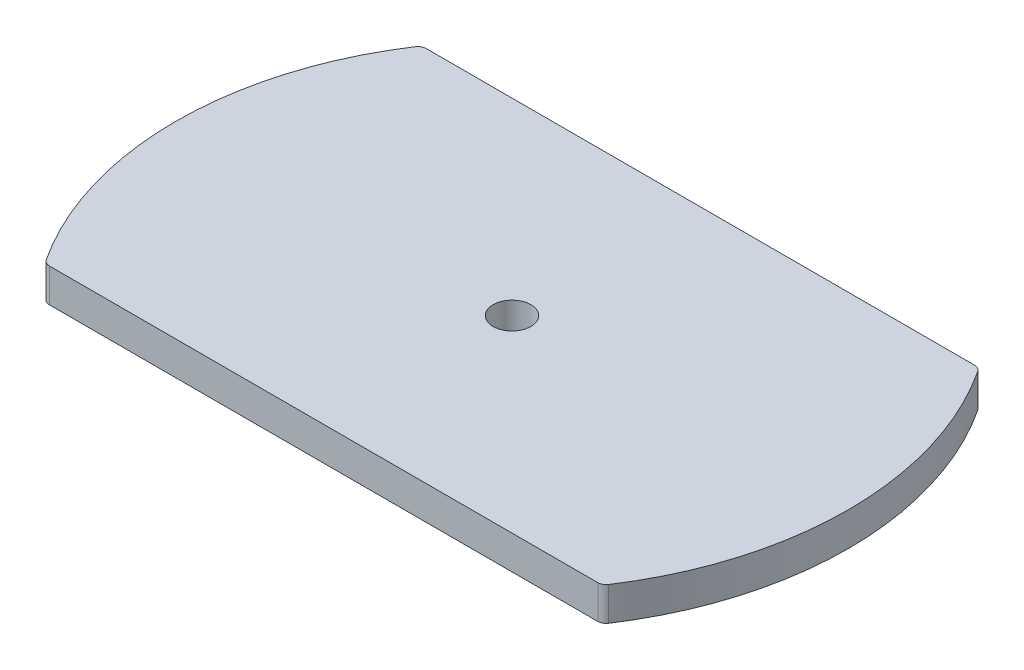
ISO-10303-21;
HEADER;
FILE_DESCRIPTION(('STEP AP214'),'2;1');
FILE_NAME('part.step','',(''),(''),'','','');
FILE_SCHEMA(('AUTOMOTIVE_DESIGN { 1 0 10303 214 1 1 1 1 }'));
ENDSEC;
DATA;
#1=APPLICATION_CONTEXT('core data for automotive mechanical design processes');
#2=APPLICATION_PROTOCOL_DEFINITION('international standard','automotive_design',2000,#1);
#3=PRODUCT_CONTEXT('',#1,'mechanical');
#4=PRODUCT('Part','Part','',(#3));
#5=PRODUCT_RELATED_PRODUCT_CATEGORY('part','',(#4));
#6=PRODUCT_DEFINITION_FORMATION('','',#4);
#7=PRODUCT_DEFINITION_CONTEXT('part definition',#1,'design');
#8=PRODUCT_DEFINITION('design','',#6,#7);
#9=PRODUCT_DEFINITION_SHAPE('','',#8);
#10=(LENGTH_UNIT() NAMED_UNIT(*) SI_UNIT(.MILLI.,.METRE.));
#11=(NAMED_UNIT(*) PLANE_ANGLE_UNIT() SI_UNIT($,.RADIAN.));
#12=(NAMED_UNIT(*) SI_UNIT($,.STERADIAN.) SOLID_ANGLE_UNIT());
#13=UNCERTAINTY_MEASURE_WITH_UNIT(LENGTH_MEASURE(1.E-05),#10,'distance_accuracy_value','');
#14=(GEOMETRIC_REPRESENTATION_CONTEXT(3) GLOBAL_UNCERTAINTY_ASSIGNED_CONTEXT((#13)) GLOBAL_UNIT_ASSIGNED_CONTEXT((#10,
#11,#12)) REPRESENTATION_CONTEXT('',''));
#15=CARTESIAN_POINT('',(0.,0.,0.));
#16=DIRECTION('',(0.,0.,1.));
#17=DIRECTION('',(1.,0.,0.));
#18=AXIS2_PLACEMENT_3D('',#15,#16,#17);
#19=CARTESIAN_POINT('',(-70.485,6.35,32.385));
#20=DIRECTION('',(0.,-1.,0.));
#21=DIRECTION('',(0.,0.,-1.));
#22=AXIS2_PLACEMENT_3D('',#19,#20,#21);
#23=PLANE('',#22);
#24=CARTESIAN_POINT('',(0.,6.35,0.));
#25=DIRECTION('',(0.,1.,0.));
#26=DIRECTION('',(0.,0.,1.));
#27=AXIS2_PLACEMENT_3D('',#24,#25,#26);
#28=CIRCLE('',#27,3.571875);
#29=CARTESIAN_POINT('',(0.,6.35,3.57187499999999));
#30=VERTEX_POINT('',#29);
#31=EDGE_CURVE('E124',#30,#30,#28,.T.);
#32=ORIENTED_EDGE('',*,*,#31,.F.);
#33=EDGE_LOOP('',(#32));
#34=FACE_BOUND('',#33,.T.);
#35=DIRECTION('',(1.,0.,0.));
#36=VECTOR('',#35,1.);
#37=CARTESIAN_POINT('',(-70.485,6.35,35.56));
#38=LINE('',#37,#36);
#39=CARTESIAN_POINT('',(-51.7593170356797,6.35,35.56));
#40=VERTEX_POINT('',#39);
#41=CARTESIAN_POINT('',(51.7593170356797,6.35,35.56));
#42=VERTEX_POINT('',#41);
#43=EDGE_CURVE('E115',#40,#42,#38,.T.);
#44=ORIENTED_EDGE('',*,*,#43,.T.);
#45=CARTESIAN_POINT('',(51.7593170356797,6.35,33.9725));
#46=DIRECTION('',(0.,-1.,0.));
#47=DIRECTION('',(0.,0.,-1.));
#48=AXIS2_PLACEMENT_3D('',#45,#46,#47);
#49=CIRCLE('',#48,1.5875);
#50=CARTESIAN_POINT('',(53.0864790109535,6.35,34.8435897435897));
#51=VERTEX_POINT('',#50);
#52=EDGE_CURVE('E140',#42,#51,#49,.F.);
#53=ORIENTED_EDGE('',*,*,#52,.T.);
#54=CARTESIAN_POINT('',(0.,6.35,0.));
#55=DIRECTION('',(0.,1.,0.));
#56=DIRECTION('',(0.,0.,1.));
#57=AXIS2_PLACEMENT_3D('',#54,#55,#56);
#58=CIRCLE('',#57,63.5);
#59=CARTESIAN_POINT('',(53.0864790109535,6.35,-34.8435897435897));
#60=VERTEX_POINT('',#59);
#61=EDGE_CURVE('E161',#51,#60,#58,.T.);
#62=ORIENTED_EDGE('',*,*,#61,.T.);
#63=CARTESIAN_POINT('',(51.7593170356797,6.35,-33.9725));
#64=DIRECTION('',(0.,-1.,0.));
#65=DIRECTION('',(0.,0.,-1.));
#66=AXIS2_PLACEMENT_3D('',#63,#64,#65);
#67=CIRCLE('',#66,1.5875);
#68=CARTESIAN_POINT('',(51.7593170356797,6.35,-35.56));
#69=VERTEX_POINT('',#68);
#70=EDGE_CURVE('E138',#60,#69,#67,.F.);
#71=ORIENTED_EDGE('',*,*,#70,.T.);
#72=DIRECTION('',(-1.,0.,0.));
#73=VECTOR('',#72,1.);
#74=CARTESIAN_POINT('',(-70.485,6.35,-35.56));
#75=LINE('',#74,#73);
#76=CARTESIAN_POINT('',(-51.7593170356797,6.35,-35.56));
#77=VERTEX_POINT('',#76);
#78=EDGE_CURVE('E117',#69,#77,#75,.T.);
#79=ORIENTED_EDGE('',*,*,#78,.T.);
#80=CARTESIAN_POINT('',(-51.7593170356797,6.35,-33.9725));
#81=DIRECTION('',(0.,-1.,0.));
#82=DIRECTION('',(0.,0.,-1.));
#83=AXIS2_PLACEMENT_3D('',#80,#81,#82);
#84=CIRCLE('',#83,1.5875);
#85=CARTESIAN_POINT('',(-53.0864790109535,6.35,-34.8435897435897));
#86=VERTEX_POINT('',#85);
#87=EDGE_CURVE('E136',#77,#86,#84,.F.);
#88=ORIENTED_EDGE('',*,*,#87,.T.);
#89=CARTESIAN_POINT('',(-53.0864790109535,6.35,34.8435897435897));
#90=VERTEX_POINT('',#89);
#91=EDGE_CURVE('E156',#86,#90,#58,.T.);
#92=ORIENTED_EDGE('',*,*,#91,.T.);
#93=CARTESIAN_POINT('',(-51.7593170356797,6.35,33.9725));
#94=DIRECTION('',(0.,-1.,0.));
#95=DIRECTION('',(0.,0.,-1.));
#96=AXIS2_PLACEMENT_3D('',#93,#94,#95);
#97=CIRCLE('',#96,1.5875);
#98=EDGE_CURVE('E134',#90,#40,#97,.F.);
#99=ORIENTED_EDGE('',*,*,#98,.T.);
#100=EDGE_LOOP('',(#44,#53,#62,#71,#79,#88,#92,#99));
#101=FACE_BOUND('',#100,.T.);
#102=ADVANCED_FACE('F32',(#34,#101),#23,.F.);
#103=CARTESIAN_POINT('',(-70.485,0.,32.385));
#104=DIRECTION('',(0.,-1.,0.));
#105=DIRECTION('',(0.,0.,-1.));
#106=AXIS2_PLACEMENT_3D('',#103,#104,#105);
#107=PLANE('',#106);
#108=CARTESIAN_POINT('',(0.,0.,0.));
#109=DIRECTION('',(0.,1.,0.));
#110=DIRECTION('',(0.,0.,1.));
#111=AXIS2_PLACEMENT_3D('',#108,#109,#110);
#112=CIRCLE('',#111,3.571875);
#113=CARTESIAN_POINT('',(0.,0.,3.57187499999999));
#114=VERTEX_POINT('',#113);
#115=EDGE_CURVE('E128',#114,#114,#112,.T.);
#116=ORIENTED_EDGE('',*,*,#115,.T.);
#117=EDGE_LOOP('',(#116));
#118=FACE_BOUND('',#117,.T.);
#119=CARTESIAN_POINT('',(0.,0.,0.));
#120=DIRECTION('',(0.,1.,0.));
#121=DIRECTION('',(0.,0.,1.));
#122=AXIS2_PLACEMENT_3D('',#119,#120,#121);
#123=CIRCLE('',#122,63.5);
#124=CARTESIAN_POINT('',(53.0864790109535,0.,34.8435897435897));
#125=VERTEX_POINT('',#124);
#126=CARTESIAN_POINT('',(53.0864790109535,0.,-34.8435897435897));
#127=VERTEX_POINT('',#126);
#128=EDGE_CURVE('E162',#125,#127,#123,.T.);
#129=ORIENTED_EDGE('',*,*,#128,.F.);
#130=CARTESIAN_POINT('',(51.7593170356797,0.,33.9725));
#131=DIRECTION('',(0.,-1.,0.));
#132=DIRECTION('',(0.,0.,-1.));
#133=AXIS2_PLACEMENT_3D('',#130,#131,#132);
#134=CIRCLE('',#133,1.5875);
#135=CARTESIAN_POINT('',(51.7593170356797,0.,35.56));
#136=VERTEX_POINT('',#135);
#137=EDGE_CURVE('E122',#125,#136,#134,.T.);
#138=ORIENTED_EDGE('',*,*,#137,.T.);
#139=DIRECTION('',(1.,0.,0.));
#140=VECTOR('',#139,1.);
#141=CARTESIAN_POINT('',(-70.485,0.,35.56));
#142=LINE('',#141,#140);
#143=CARTESIAN_POINT('',(-51.7593170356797,0.,35.56));
#144=VERTEX_POINT('',#143);
#145=EDGE_CURVE('E112',#144,#136,#142,.T.);
#146=ORIENTED_EDGE('',*,*,#145,.F.);
#147=CARTESIAN_POINT('',(-51.7593170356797,0.,33.9725));
#148=DIRECTION('',(0.,-1.,0.));
#149=DIRECTION('',(0.,0.,-1.));
#150=AXIS2_PLACEMENT_3D('',#147,#148,#149);
#151=CIRCLE('',#150,1.5875);
#152=CARTESIAN_POINT('',(-53.0864790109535,0.,34.8435897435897));
#153=VERTEX_POINT('',#152);
#154=EDGE_CURVE('E99',#144,#153,#151,.T.);
#155=ORIENTED_EDGE('',*,*,#154,.T.);
#156=CARTESIAN_POINT('',(-53.0864790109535,0.,-34.8435897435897));
#157=VERTEX_POINT('',#156);
#158=EDGE_CURVE('E158',#157,#153,#123,.T.);
#159=ORIENTED_EDGE('',*,*,#158,.F.);
#160=CARTESIAN_POINT('',(-51.7593170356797,0.,-33.9725));
#161=DIRECTION('',(0.,-1.,0.));
#162=DIRECTION('',(0.,0.,-1.));
#163=AXIS2_PLACEMENT_3D('',#160,#161,#162);
#164=CIRCLE('',#163,1.5875);
#165=CARTESIAN_POINT('',(-51.7593170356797,0.,-35.56));
#166=VERTEX_POINT('',#165);
#167=EDGE_CURVE('E47',#157,#166,#164,.T.);
#168=ORIENTED_EDGE('',*,*,#167,.T.);
#169=DIRECTION('',(-1.,0.,0.));
#170=VECTOR('',#169,1.);
#171=CARTESIAN_POINT('',(-70.485,0.,-35.56));
#172=LINE('',#171,#170);
#173=CARTESIAN_POINT('',(51.7593170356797,0.,-35.56));
#174=VERTEX_POINT('',#173);
#175=EDGE_CURVE('E123',#174,#166,#172,.T.);
#176=ORIENTED_EDGE('',*,*,#175,.F.);
#177=CARTESIAN_POINT('',(51.7593170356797,0.,-33.9725));
#178=DIRECTION('',(0.,-1.,0.));
#179=DIRECTION('',(0.,0.,-1.));
#180=AXIS2_PLACEMENT_3D('',#177,#178,#179);
#181=CIRCLE('',#180,1.5875);
#182=EDGE_CURVE('E55',#174,#127,#181,.T.);
#183=ORIENTED_EDGE('',*,*,#182,.T.);
#184=EDGE_LOOP('',(#129,#138,#146,#155,#159,#168,#176,#183));
#185=FACE_BOUND('',#184,.T.);
#186=ADVANCED_FACE('F120',(#118,#185),#107,.T.);
#187=CARTESIAN_POINT('',(-70.485,6.35,35.56));
#188=DIRECTION('',(0.,0.,-1.));
#189=DIRECTION('',(-1.,0.,0.));
#190=AXIS2_PLACEMENT_3D('',#187,#188,#189);
#191=PLANE('',#190);
#192=ORIENTED_EDGE('',*,*,#145,.T.);
#193=DIRECTION('',(0.,-1.,0.));
#194=VECTOR('',#193,1.);
#195=CARTESIAN_POINT('',(51.7593170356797,6.35,35.56));
#196=LINE('',#195,#194);
#197=EDGE_CURVE('E116',#136,#42,#196,.F.);
#198=ORIENTED_EDGE('',*,*,#197,.T.);
#199=ORIENTED_EDGE('',*,*,#43,.F.);
#200=DIRECTION('',(0.,-1.,0.));
#201=VECTOR('',#200,1.);
#202=CARTESIAN_POINT('',(-51.7593170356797,6.35,35.56));
#203=LINE('',#202,#201);
#204=EDGE_CURVE('E102',#40,#144,#203,.T.);
#205=ORIENTED_EDGE('',*,*,#204,.T.);
#206=EDGE_LOOP('',(#192,#198,#199,#205));
#207=FACE_BOUND('',#206,.T.);
#208=ADVANCED_FACE('F110',(#207),#191,.F.);
#209=CARTESIAN_POINT('',(-70.485,6.35,-35.56));
#210=DIRECTION('',(0.,0.,1.));
#211=DIRECTION('',(1.,0.,0.));
#212=AXIS2_PLACEMENT_3D('',#209,#210,#211);
#213=PLANE('',#212);
#214=ORIENTED_EDGE('',*,*,#78,.F.);
#215=DIRECTION('',(0.,-1.,0.));
#216=VECTOR('',#215,1.);
#217=CARTESIAN_POINT('',(51.7593170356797,6.35,-35.56));
#218=LINE('',#217,#216);
#219=EDGE_CURVE('E151',#69,#174,#218,.T.);
#220=ORIENTED_EDGE('',*,*,#219,.T.);
#221=ORIENTED_EDGE('',*,*,#175,.T.);
#222=DIRECTION('',(0.,-1.,0.));
#223=VECTOR('',#222,1.);
#224=CARTESIAN_POINT('',(-51.7593170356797,6.35,-35.56));
#225=LINE('',#224,#223);
#226=EDGE_CURVE('E148',#166,#77,#225,.F.);
#227=ORIENTED_EDGE('',*,*,#226,.T.);
#228=EDGE_LOOP('',(#214,#220,#221,#227));
#229=FACE_BOUND('',#228,.T.);
#230=ADVANCED_FACE('F172',(#229),#213,.F.);
#231=CARTESIAN_POINT('',(0.,6.35,0.));
#232=DIRECTION('',(0.,-1.,0.));
#233=DIRECTION('',(0.,0.,-1.));
#234=AXIS2_PLACEMENT_3D('',#231,#232,#233);
#235=CYLINDRICAL_SURFACE('',#234,3.571875);
#236=ORIENTED_EDGE('',*,*,#31,.T.);
#237=EDGE_LOOP('',(#236));
#238=FACE_BOUND('',#237,.T.);
#239=ORIENTED_EDGE('',*,*,#115,.F.);
#240=EDGE_LOOP('',(#239));
#241=FACE_BOUND('',#240,.T.);
#242=ADVANCED_FACE('F200',(#238,#241),#235,.F.);
#243=CARTESIAN_POINT('',(0.,6.35,0.));
#244=DIRECTION('',(0.,-1.,0.));
#245=DIRECTION('',(0.,0.,-1.));
#246=AXIS2_PLACEMENT_3D('',#243,#244,#245);
#247=CYLINDRICAL_SURFACE('',#246,63.5);
#248=ORIENTED_EDGE('',*,*,#61,.F.);
#249=DIRECTION('',(0.,-1.,0.));
#250=VECTOR('',#249,1.);
#251=CARTESIAN_POINT('',(53.0864790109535,6.35,34.8435897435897));
#252=LINE('',#251,#250);
#253=EDGE_CURVE('E105',#51,#125,#252,.T.);
#254=ORIENTED_EDGE('',*,*,#253,.T.);
#255=ORIENTED_EDGE('',*,*,#128,.T.);
#256=DIRECTION('',(0.,-1.,0.));
#257=VECTOR('',#256,1.);
#258=CARTESIAN_POINT('',(53.0864790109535,6.35,-34.8435897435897));
#259=LINE('',#258,#257);
#260=EDGE_CURVE('E142',#127,#60,#259,.F.);
#261=ORIENTED_EDGE('',*,*,#260,.T.);
#262=EDGE_LOOP('',(#248,#254,#255,#261));
#263=FACE_BOUND('',#262,.T.);
#264=ADVANCED_FACE('F177',(#263),#247,.T.);
#265=ORIENTED_EDGE('',*,*,#91,.F.);
#266=DIRECTION('',(0.,-1.,0.));
#267=VECTOR('',#266,1.);
#268=CARTESIAN_POINT('',(-53.0864790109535,6.35,-34.8435897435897));
#269=LINE('',#268,#267);
#270=EDGE_CURVE('E11',#86,#157,#269,.T.);
#271=ORIENTED_EDGE('',*,*,#270,.T.);
#272=ORIENTED_EDGE('',*,*,#158,.T.);
#273=DIRECTION('',(0.,-1.,0.));
#274=VECTOR('',#273,1.);
#275=CARTESIAN_POINT('',(-53.0864790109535,6.35,34.8435897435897));
#276=LINE('',#275,#274);
#277=EDGE_CURVE('E40',#153,#90,#276,.F.);
#278=ORIENTED_EDGE('',*,*,#277,.T.);
#279=EDGE_LOOP('',(#265,#271,#272,#278));
#280=FACE_BOUND('',#279,.T.);
#281=ADVANCED_FACE('F155',(#280),#247,.T.);
#282=CARTESIAN_POINT('',(51.7593170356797,6.35,33.9725));
#283=DIRECTION('',(0.,-1.,0.));
#284=DIRECTION('',(0.,0.,-1.));
#285=AXIS2_PLACEMENT_3D('',#282,#283,#284);
#286=CYLINDRICAL_SURFACE('',#285,1.5875);
#287=ORIENTED_EDGE('',*,*,#137,.F.);
#288=ORIENTED_EDGE('',*,*,#253,.F.);
#289=ORIENTED_EDGE('',*,*,#52,.F.);
#290=ORIENTED_EDGE('',*,*,#197,.F.);
#291=EDGE_LOOP('',(#287,#288,#289,#290));
#292=FACE_BOUND('',#291,.T.);
#293=ADVANCED_FACE('F180',(#292),#286,.T.);
#294=CARTESIAN_POINT('',(51.7593170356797,6.35,-33.9725));
#295=DIRECTION('',(0.,-1.,0.));
#296=DIRECTION('',(0.,0.,-1.));
#297=AXIS2_PLACEMENT_3D('',#294,#295,#296);
#298=CYLINDRICAL_SURFACE('',#297,1.5875);
#299=ORIENTED_EDGE('',*,*,#70,.F.);
#300=ORIENTED_EDGE('',*,*,#260,.F.);
#301=ORIENTED_EDGE('',*,*,#182,.F.);
#302=ORIENTED_EDGE('',*,*,#219,.F.);
#303=EDGE_LOOP('',(#299,#300,#301,#302));
#304=FACE_BOUND('',#303,.T.);
#305=ADVANCED_FACE('F174',(#304),#298,.T.);
#306=CARTESIAN_POINT('',(-51.7593170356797,6.35,-33.9725));
#307=DIRECTION('',(0.,-1.,0.));
#308=DIRECTION('',(0.,0.,-1.));
#309=AXIS2_PLACEMENT_3D('',#306,#307,#308);
#310=CYLINDRICAL_SURFACE('',#309,1.5875);
#311=ORIENTED_EDGE('',*,*,#167,.F.);
#312=ORIENTED_EDGE('',*,*,#270,.F.);
#313=ORIENTED_EDGE('',*,*,#87,.F.);
#314=ORIENTED_EDGE('',*,*,#226,.F.);
#315=EDGE_LOOP('',(#311,#312,#313,#314));
#316=FACE_BOUND('',#315,.T.);
#317=ADVANCED_FACE('F182',(#316),#310,.T.);
#318=CARTESIAN_POINT('',(-51.7593170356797,6.35,33.9725));
#319=DIRECTION('',(0.,-1.,0.));
#320=DIRECTION('',(0.,0.,-1.));
#321=AXIS2_PLACEMENT_3D('',#318,#319,#320);
#322=CYLINDRICAL_SURFACE('',#321,1.5875);
#323=ORIENTED_EDGE('',*,*,#98,.F.);
#324=ORIENTED_EDGE('',*,*,#277,.F.);
#325=ORIENTED_EDGE('',*,*,#154,.F.);
#326=ORIENTED_EDGE('',*,*,#204,.F.);
#327=EDGE_LOOP('',(#323,#324,#325,#326));
#328=FACE_BOUND('',#327,.T.);
#329=ADVANCED_FACE('F34',(#328),#322,.T.);
#330=CLOSED_SHELL('',(#102,#186,#208,#230,#242,#264,#281,#293,#305,#317,#329));
#331=MANIFOLD_SOLID_BREP('B2',#330);
#332=ADVANCED_BREP_SHAPE_REPRESENTATION('',(#18,#331),#14);
#333=SHAPE_DEFINITION_REPRESENTATION(#9,#332);
ENDSEC;
END-ISO-10303-21;
